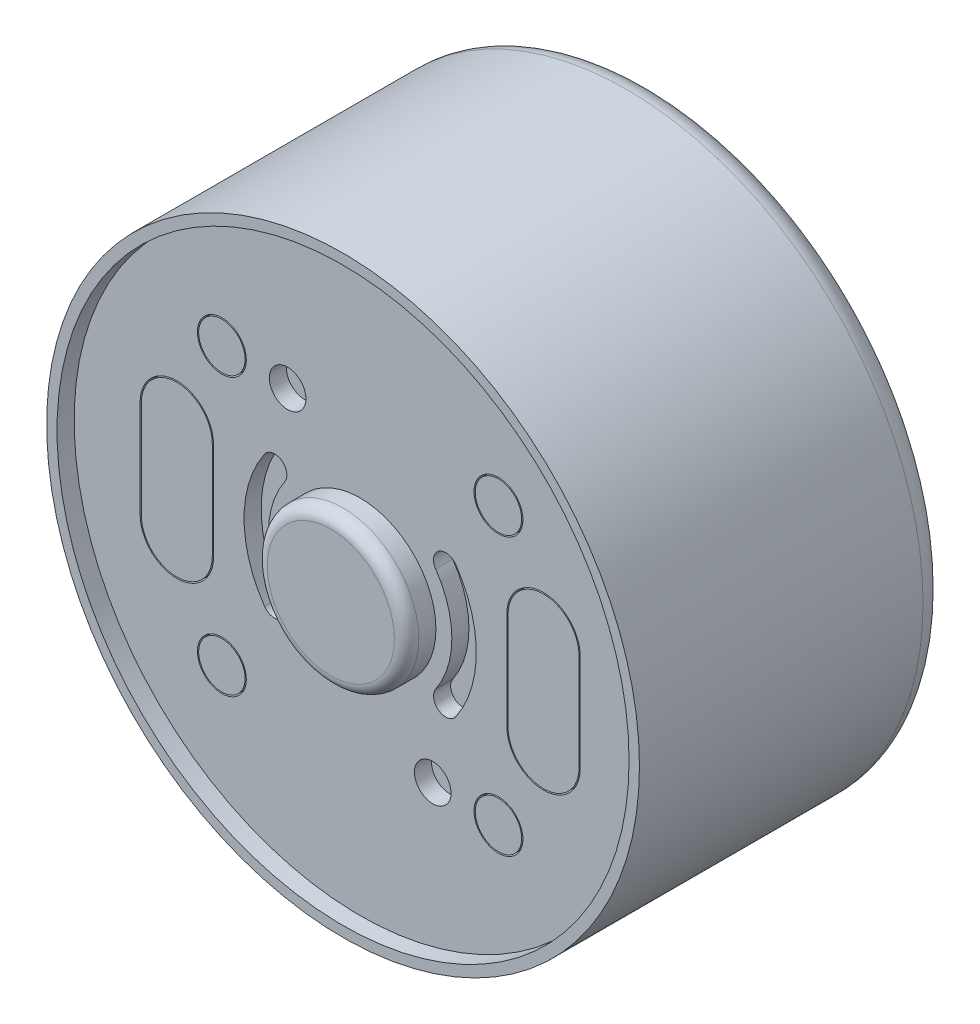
from build123d import *

# Parameters (mm, degrees)
ESQUISSE1_R             = 12.125
EXTRUSION1_DEPTH        = 12.6
ESQUISSE2_R             = 1
EXTRUSION2_DEPTH        = 7
CONG_1_R                = 1
CONG_2_R                = 0.2
ESQUISSE3_R             = 3.25
EXTRUSION3_DEPTH        = 0.5
ESQUISSE4_R             = 2.5
ESQUISSE4_R_2           = 2.45
ENL_V_MAT_EXTRU_1_DEPTH = 0.1
ESQUISSE5_R             = 11.7
ENL_V_MAT_EXTRU_2_DEPTH = 0.7
ESQUISSE6_R             = 0.75
ESQUISSE6_R_2           = 1
ESQUISSE6_R_3           = 0.95
ENL_V_MAT_EXTRU_3_DEPTH = 0.7
ESQUISSE7_R             = 3.1
EXTRUSION4_DEPTH        = 1.2
CONG_3_R                = 0.5


with BuildPart() as part:
    # Esquisse1 → Extrusion1 (new body)
    with BuildSketch(Plane.XY):
        Circle(ESQUISSE1_R)
    extrude(amount=-EXTRUSION1_DEPTH)

    # Esquisse2 → Extrusion2 (add)
    with BuildSketch(Plane(origin=(0, 0, -12.6), x_dir=(-1, 0, 0), z_dir=(0, 0, -1))):
        with Locations(Location((0, 0, 0), (0, 0, 180))):
            Circle(ESQUISSE2_R)
    extrude(amount=EXTRUSION2_DEPTH)

    # Cong_1
    cong_1_edges = [part.edges().sort_by_distance(p)[0] for p in [
        (-12.125, 0, -12.6),
    ]]
    fillet(cong_1_edges, radius=CONG_1_R)

    # Cong_2
    cong_2_edges = [part.edges().sort_by_distance(p)[0] for p in [
        (-1, 0, -19.6),
    ]]
    fillet(cong_2_edges, radius=CONG_2_R)

    # Esquisse3 → Extrusion3 (add)
    with BuildSketch(Plane(origin=(0, 0, -12.6), x_dir=(-1, 0, 0), z_dir=(0, 0, -1))):
        with Locations(Location((0, 0, 0), (0, 0, 180))):
            Circle(ESQUISSE3_R)
    extrude(amount=EXTRUSION3_DEPTH)

    # Esquisse4 → Enl_v. mat.-Extru.1 (cut)
    with BuildSketch(Plane(origin=(0, 0, -13.1), x_dir=(-1, 0, 0), z_dir=(0, 0, -1))):
        Circle(ESQUISSE4_R)
        Circle(ESQUISSE4_R_2, mode=Mode.SUBTRACT)
    extrude(amount=-ENL_V_MAT_EXTRU_1_DEPTH, mode=Mode.SUBTRACT)

    # Esquisse5 → Enl_v. mat.-Extru.2 (cut)
    with BuildSketch(Plane.XY):
        Circle(ESQUISSE5_R)
    extrude(amount=-ENL_V_MAT_EXTRU_2_DEPTH, mode=Mode.SUBTRACT)

    # Esquisse6 → Enl_v. mat.-Extru.3 (cut)
    # profile 1 of 10: a face of its own
    with BuildSketch(Plane.XY.offset(-0.7)):
        with Locations((-2.968585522, 5.5)):
            Circle(ESQUISSE6_R)
    # profile 2 of 10: a face of its own
    with BuildSketch(Plane.XY.offset(-0.7)):
        with Locations((2.968585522, -5.5)):
            Circle(ESQUISSE6_R)
    # profile 3 of 10: a face of its own
    with BuildSketch(Plane.XY.offset(-0.7)):
        with Locations((-5.656854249, 5.656854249)):
            Circle(ESQUISSE6_R_2)
        with Locations((-5.656854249, 5.656854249)):
            Circle(ESQUISSE6_R_3, mode=Mode.SUBTRACT)
    # profile 4 of 10: a face of its own
    with BuildSketch(Plane.XY.offset(-0.7)):
        with Locations((-5.656854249, -5.656854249)):
            Circle(ESQUISSE6_R_2)
        with Locations((-5.656854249, -5.656854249)):
            Circle(ESQUISSE6_R_3, mode=Mode.SUBTRACT)
    # profile 5 of 10: a face of its own
    with BuildSketch(Plane.XY.offset(-0.7)):
        with Locations((5.656854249, -5.656854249)):
            Circle(ESQUISSE6_R_2)
        with Locations((5.656854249, -5.656854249)):
            Circle(ESQUISSE6_R_3, mode=Mode.SUBTRACT)
    # profile 6 of 10: a face of its own
    with BuildSketch(Plane.XY.offset(-0.7)):
        with Locations((5.656854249, 5.656854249)):
            Circle(ESQUISSE6_R_2)
        with Locations((5.656854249, 5.656854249)):
            Circle(ESQUISSE6_R_3, mode=Mode.SUBTRACT)
    # profile 7 of 10: a face of its own
    with BuildSketch(Plane.XY.offset(-0.7)):
        with BuildLine():
            Line((-9, 2), (-9, -2))
            ThreePointArc((-9, -2), (-7.5, -3.5), (-6, -2))
            Line((-6, -2), (-6, 2))
            ThreePointArc((-6, 2), (-7.5, 3.5), (-9, 2))
        make_face()
        with BuildLine():
            Line((-8.95, 2), (-8.95, -2))
            ThreePointArc((-8.95, -2), (-7.5, -3.45), (-6.05, -2))
            Line((-6.05, -2), (-6.05, 2))
            ThreePointArc((-6.05, 2), (-7.5, 3.45), (-8.95, 2))
        make_face(mode=Mode.SUBTRACT)
    # profile 8 of 10: a face of its own
    with BuildSketch(Plane.XY.offset(-0.7)):
        with BuildLine():
            Line((6, 2), (6, -2))
            ThreePointArc((6, -2), (7.5, -3.5), (9, -2))
            Line((9, -2), (9, 2))
            ThreePointArc((9, 2), (7.5, 3.5), (6, 2))
        make_face()
        with BuildLine():
            Line((6.05, 2), (6.05, -2))
            ThreePointArc((6.05, -2), (7.5, -3.45), (8.95, -2))
            Line((8.95, -2), (8.95, 2))
            ThreePointArc((8.95, 2), (7.5, 3.45), (6.05, 2))
        make_face(mode=Mode.SUBTRACT)
    # profile 9 of 10: a face of its own
    with BuildSketch(Plane.XY.offset(-0.7)):
        with BuildLine():
            ThreePointArc((3.911764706, -2.694549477), (4.75, 0), (3.911764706, 2.694549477))
            ThreePointArc((3.911764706, 2.694549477), (3.216363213, 2.822677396), (3.088235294, 2.127275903))
            ThreePointArc((3.088235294, 2.127275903), (3.75, 0), (3.088235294, -2.127275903))
            ThreePointArc((3.088235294, -2.127275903), (3.216363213, -2.822677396), (3.911764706, -2.694549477))
        make_face()
    # profile 10 of 10: a face of its own
    with BuildSketch(Plane.XY.offset(-0.7)):
        with BuildLine():
            ThreePointArc((-3.088235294, 2.127275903), (-3.216363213, 2.822677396), (-3.911764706, 2.694549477))
            ThreePointArc((-3.911764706, 2.694549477), (-4.75, 0), (-3.911764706, -2.694549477))
            ThreePointArc((-3.911764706, -2.694549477), (-3.216363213, -2.822677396), (-3.088235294, -2.127275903))
            ThreePointArc((-3.088235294, -2.127275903), (-3.75, 0), (-3.088235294, 2.127275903))
        make_face()
    extrude(amount=-ENL_V_MAT_EXTRU_3_DEPTH, mode=Mode.SUBTRACT)

    # Esquisse7 → Extrusion4 (add)
    with BuildSketch(Plane.XY.offset(-0.7)):
        Circle(ESQUISSE7_R)
    extrude(amount=EXTRUSION4_DEPTH)

    # Cong_3
    cong_3_edges = [part.edges().sort_by_distance(p)[0] for p in [
        (-3.1, 0, 0.5),
    ]]
    fillet(cong_3_edges, radius=CONG_3_R)


solid = part.part
